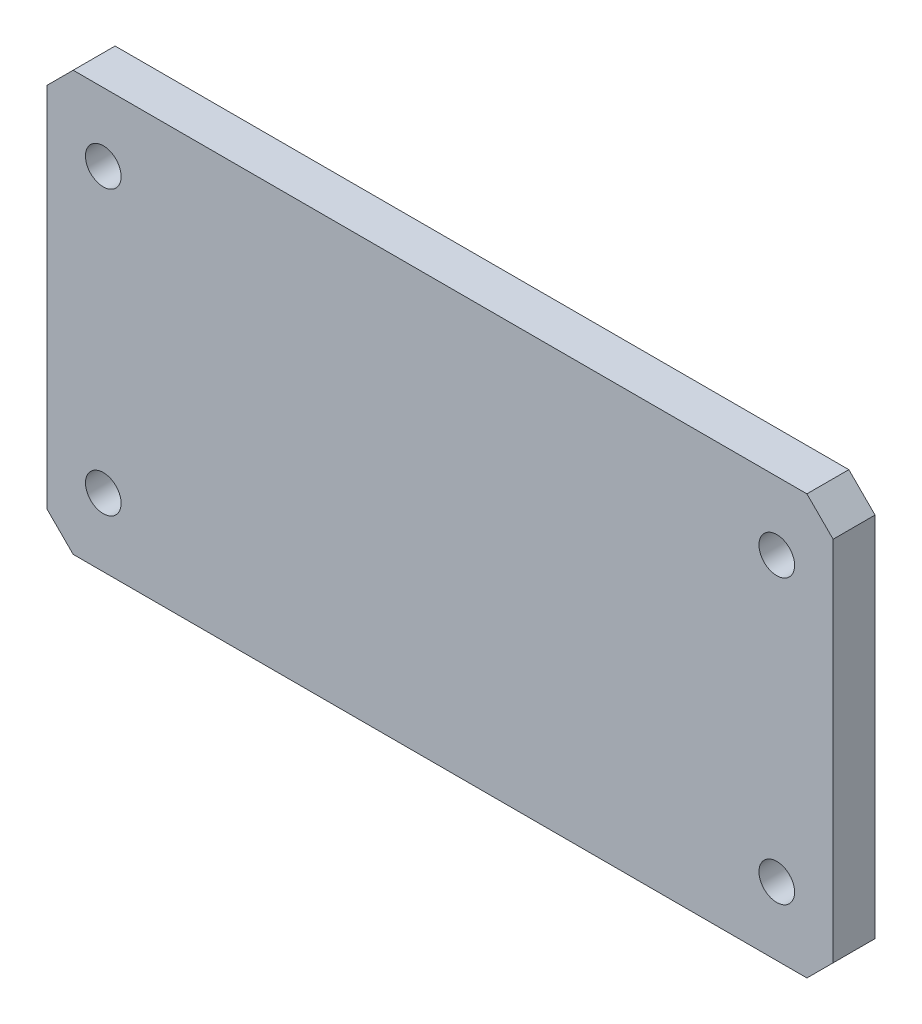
ISO-10303-21;
HEADER;
FILE_DESCRIPTION(('STEP AP214'),'2;1');
FILE_NAME('part.step','',(''),(''),'','','');
FILE_SCHEMA(('AUTOMOTIVE_DESIGN { 1 0 10303 214 1 1 1 1 }'));
ENDSEC;
DATA;
#1=APPLICATION_CONTEXT('core data for automotive mechanical design processes');
#2=APPLICATION_PROTOCOL_DEFINITION('international standard','automotive_design',2000,#1);
#3=PRODUCT_CONTEXT('',#1,'mechanical');
#4=PRODUCT('Part','Part','',(#3));
#5=PRODUCT_RELATED_PRODUCT_CATEGORY('part','',(#4));
#6=PRODUCT_DEFINITION_FORMATION('','',#4);
#7=PRODUCT_DEFINITION_CONTEXT('part definition',#1,'design');
#8=PRODUCT_DEFINITION('design','',#6,#7);
#9=PRODUCT_DEFINITION_SHAPE('','',#8);
#10=(LENGTH_UNIT() NAMED_UNIT(*) SI_UNIT(.MILLI.,.METRE.));
#11=(NAMED_UNIT(*) PLANE_ANGLE_UNIT() SI_UNIT($,.RADIAN.));
#12=(NAMED_UNIT(*) SI_UNIT($,.STERADIAN.) SOLID_ANGLE_UNIT());
#13=UNCERTAINTY_MEASURE_WITH_UNIT(LENGTH_MEASURE(1.E-05),#10,'distance_accuracy_value','');
#14=(GEOMETRIC_REPRESENTATION_CONTEXT(3) GLOBAL_UNCERTAINTY_ASSIGNED_CONTEXT((#13)) GLOBAL_UNIT_ASSIGNED_CONTEXT((#10,
#11,#12)) REPRESENTATION_CONTEXT('',''));
#15=CARTESIAN_POINT('',(0.,0.,0.));
#16=DIRECTION('',(0.,0.,1.));
#17=DIRECTION('',(1.,0.,0.));
#18=AXIS2_PLACEMENT_3D('',#15,#16,#17);
#19=CARTESIAN_POINT('',(75.,-40.,8.));
#20=DIRECTION('',(-1.,0.,0.));
#21=DIRECTION('',(0.,0.,1.));
#22=AXIS2_PLACEMENT_3D('',#19,#20,#21);
#23=PLANE('',#22);
#24=DIRECTION('',(0.,1.,0.));
#25=VECTOR('',#24,1.);
#26=CARTESIAN_POINT('',(75.,-40.,8.));
#27=LINE('',#26,#25);
#28=CARTESIAN_POINT('',(75.,-35.,8.));
#29=VERTEX_POINT('',#28);
#30=CARTESIAN_POINT('',(75.,35.,8.));
#31=VERTEX_POINT('',#30);
#32=EDGE_CURVE('E107',#29,#31,#27,.T.);
#33=ORIENTED_EDGE('',*,*,#32,.F.);
#34=DIRECTION('',(0.,0.,-1.));
#35=VECTOR('',#34,1.);
#36=CARTESIAN_POINT('',(75.,-35.,8.));
#37=LINE('',#36,#35);
#38=CARTESIAN_POINT('',(75.,-35.,0.));
#39=VERTEX_POINT('',#38);
#40=EDGE_CURVE('E133',#29,#39,#37,.T.);
#41=ORIENTED_EDGE('',*,*,#40,.T.);
#42=DIRECTION('',(0.,1.,0.));
#43=VECTOR('',#42,1.);
#44=CARTESIAN_POINT('',(75.,-40.,0.));
#45=LINE('',#44,#43);
#46=CARTESIAN_POINT('',(75.,35.,0.));
#47=VERTEX_POINT('',#46);
#48=EDGE_CURVE('E141',#39,#47,#45,.T.);
#49=ORIENTED_EDGE('',*,*,#48,.T.);
#50=DIRECTION('',(0.,0.,1.));
#51=VECTOR('',#50,1.);
#52=CARTESIAN_POINT('',(75.,35.,8.));
#53=LINE('',#52,#51);
#54=EDGE_CURVE('E131',#47,#31,#53,.T.);
#55=ORIENTED_EDGE('',*,*,#54,.T.);
#56=EDGE_LOOP('',(#33,#41,#49,#55));
#57=FACE_BOUND('',#56,.T.);
#58=ADVANCED_FACE('F16',(#57),#23,.F.);
#59=CARTESIAN_POINT('',(-75.,40.,8.));
#60=DIRECTION('',(0.,-1.,0.));
#61=DIRECTION('',(0.,0.,-1.));
#62=AXIS2_PLACEMENT_3D('',#59,#60,#61);
#63=PLANE('',#62);
#64=DIRECTION('',(-1.,0.,0.));
#65=VECTOR('',#64,1.);
#66=CARTESIAN_POINT('',(-75.,40.,0.));
#67=LINE('',#66,#65);
#68=CARTESIAN_POINT('',(70.,40.,0.));
#69=VERTEX_POINT('',#68);
#70=CARTESIAN_POINT('',(-70.,40.,0.));
#71=VERTEX_POINT('',#70);
#72=EDGE_CURVE('E112',#69,#71,#67,.T.);
#73=ORIENTED_EDGE('',*,*,#72,.T.);
#74=DIRECTION('',(0.,0.,1.));
#75=VECTOR('',#74,1.);
#76=CARTESIAN_POINT('',(-70.,40.,8.));
#77=LINE('',#76,#75);
#78=CARTESIAN_POINT('',(-70.,40.,8.));
#79=VERTEX_POINT('',#78);
#80=EDGE_CURVE('E11',#71,#79,#77,.T.);
#81=ORIENTED_EDGE('',*,*,#80,.T.);
#82=DIRECTION('',(-1.,0.,0.));
#83=VECTOR('',#82,1.);
#84=CARTESIAN_POINT('',(-75.,40.,8.));
#85=LINE('',#84,#83);
#86=CARTESIAN_POINT('',(70.,40.,8.));
#87=VERTEX_POINT('',#86);
#88=EDGE_CURVE('E110',#87,#79,#85,.T.);
#89=ORIENTED_EDGE('',*,*,#88,.F.);
#90=DIRECTION('',(0.,0.,-1.));
#91=VECTOR('',#90,1.);
#92=CARTESIAN_POINT('',(70.,40.,8.));
#93=LINE('',#92,#91);
#94=EDGE_CURVE('E24',#87,#69,#93,.T.);
#95=ORIENTED_EDGE('',*,*,#94,.T.);
#96=EDGE_LOOP('',(#73,#81,#89,#95));
#97=FACE_BOUND('',#96,.T.);
#98=ADVANCED_FACE('F138',(#97),#63,.F.);
#99=CARTESIAN_POINT('',(-75.,-40.,8.));
#100=DIRECTION('',(1.,0.,0.));
#101=DIRECTION('',(0.,0.,-1.));
#102=AXIS2_PLACEMENT_3D('',#99,#100,#101);
#103=PLANE('',#102);
#104=DIRECTION('',(0.,-1.,0.));
#105=VECTOR('',#104,1.);
#106=CARTESIAN_POINT('',(-75.,-40.,0.));
#107=LINE('',#106,#105);
#108=CARTESIAN_POINT('',(-75.,35.,0.));
#109=VERTEX_POINT('',#108);
#110=CARTESIAN_POINT('',(-75.,-35.,0.));
#111=VERTEX_POINT('',#110);
#112=EDGE_CURVE('E108',#109,#111,#107,.T.);
#113=ORIENTED_EDGE('',*,*,#112,.T.);
#114=DIRECTION('',(0.,0.,1.));
#115=VECTOR('',#114,1.);
#116=CARTESIAN_POINT('',(-75.,-35.,8.));
#117=LINE('',#116,#115);
#118=CARTESIAN_POINT('',(-75.,-35.,8.));
#119=VERTEX_POINT('',#118);
#120=EDGE_CURVE('E86',#111,#119,#117,.T.);
#121=ORIENTED_EDGE('',*,*,#120,.T.);
#122=DIRECTION('',(0.,-1.,0.));
#123=VECTOR('',#122,1.);
#124=CARTESIAN_POINT('',(-75.,-40.,8.));
#125=LINE('',#124,#123);
#126=CARTESIAN_POINT('',(-75.,35.,8.));
#127=VERTEX_POINT('',#126);
#128=EDGE_CURVE('E146',#127,#119,#125,.T.);
#129=ORIENTED_EDGE('',*,*,#128,.F.);
#130=DIRECTION('',(0.,0.,-1.));
#131=VECTOR('',#130,1.);
#132=CARTESIAN_POINT('',(-75.,35.,8.));
#133=LINE('',#132,#131);
#134=EDGE_CURVE('E91',#127,#109,#133,.T.);
#135=ORIENTED_EDGE('',*,*,#134,.T.);
#136=EDGE_LOOP('',(#113,#121,#129,#135));
#137=FACE_BOUND('',#136,.T.);
#138=ADVANCED_FACE('F208',(#137),#103,.F.);
#139=CARTESIAN_POINT('',(-75.,-40.,8.));
#140=DIRECTION('',(0.,1.,0.));
#141=DIRECTION('',(0.,0.,1.));
#142=AXIS2_PLACEMENT_3D('',#139,#140,#141);
#143=PLANE('',#142);
#144=DIRECTION('',(1.,0.,0.));
#145=VECTOR('',#144,1.);
#146=CARTESIAN_POINT('',(-75.,-40.,8.));
#147=LINE('',#146,#145);
#148=CARTESIAN_POINT('',(-70.,-40.,8.));
#149=VERTEX_POINT('',#148);
#150=CARTESIAN_POINT('',(70.,-40.,8.));
#151=VERTEX_POINT('',#150);
#152=EDGE_CURVE('E101',#149,#151,#147,.T.);
#153=ORIENTED_EDGE('',*,*,#152,.F.);
#154=DIRECTION('',(0.,0.,-1.));
#155=VECTOR('',#154,1.);
#156=CARTESIAN_POINT('',(-70.,-40.,8.));
#157=LINE('',#156,#155);
#158=CARTESIAN_POINT('',(-70.,-40.,0.));
#159=VERTEX_POINT('',#158);
#160=EDGE_CURVE('E85',#149,#159,#157,.T.);
#161=ORIENTED_EDGE('',*,*,#160,.T.);
#162=DIRECTION('',(1.,0.,0.));
#163=VECTOR('',#162,1.);
#164=CARTESIAN_POINT('',(-75.,-40.,0.));
#165=LINE('',#164,#163);
#166=CARTESIAN_POINT('',(70.,-40.,0.));
#167=VERTEX_POINT('',#166);
#168=EDGE_CURVE('E98',#159,#167,#165,.T.);
#169=ORIENTED_EDGE('',*,*,#168,.T.);
#170=DIRECTION('',(0.,0.,1.));
#171=VECTOR('',#170,1.);
#172=CARTESIAN_POINT('',(70.,-40.,8.));
#173=LINE('',#172,#171);
#174=EDGE_CURVE('E103',#167,#151,#173,.T.);
#175=ORIENTED_EDGE('',*,*,#174,.T.);
#176=EDGE_LOOP('',(#153,#161,#169,#175));
#177=FACE_BOUND('',#176,.T.);
#178=ADVANCED_FACE('F97',(#177),#143,.F.);
#179=CARTESIAN_POINT('',(0.,0.,8.));
#180=DIRECTION('',(0.,0.,-1.));
#181=DIRECTION('',(-1.,0.,0.));
#182=AXIS2_PLACEMENT_3D('',#179,#180,#181);
#183=PLANE('',#182);
#184=CARTESIAN_POINT('',(64.2499999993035,27.,8.));
#185=DIRECTION('',(0.,0.,-1.));
#186=DIRECTION('',(-1.,0.,0.));
#187=AXIS2_PLACEMENT_3D('',#184,#185,#186);
#188=CIRCLE('',#187,3.4);
#189=CARTESIAN_POINT('',(60.8499999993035,27.,8.));
#190=VERTEX_POINT('',#189);
#191=EDGE_CURVE('E167',#190,#190,#188,.T.);
#192=ORIENTED_EDGE('',*,*,#191,.T.);
#193=EDGE_LOOP('',(#192));
#194=FACE_BOUND('',#193,.T.);
#195=CARTESIAN_POINT('',(-64.2499999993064,27.,8.));
#196=DIRECTION('',(0.,0.,-1.));
#197=DIRECTION('',(-1.,0.,0.));
#198=AXIS2_PLACEMENT_3D('',#195,#196,#197);
#199=CIRCLE('',#198,3.4);
#200=CARTESIAN_POINT('',(-67.6499999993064,27.,8.));
#201=VERTEX_POINT('',#200);
#202=EDGE_CURVE('E161',#201,#201,#199,.T.);
#203=ORIENTED_EDGE('',*,*,#202,.T.);
#204=EDGE_LOOP('',(#203));
#205=FACE_BOUND('',#204,.T.);
#206=CARTESIAN_POINT('',(64.2499999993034,-27.,8.));
#207=DIRECTION('',(0.,0.,-1.));
#208=DIRECTION('',(-1.,0.,0.));
#209=AXIS2_PLACEMENT_3D('',#206,#207,#208);
#210=CIRCLE('',#209,3.4);
#211=CARTESIAN_POINT('',(60.8499999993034,-27.,8.));
#212=VERTEX_POINT('',#211);
#213=EDGE_CURVE('E155',#212,#212,#210,.T.);
#214=ORIENTED_EDGE('',*,*,#213,.T.);
#215=EDGE_LOOP('',(#214));
#216=FACE_BOUND('',#215,.T.);
#217=CARTESIAN_POINT('',(-64.2499999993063,-27.,8.));
#218=DIRECTION('',(0.,0.,-1.));
#219=DIRECTION('',(-1.,0.,0.));
#220=AXIS2_PLACEMENT_3D('',#217,#218,#219);
#221=CIRCLE('',#220,3.4);
#222=CARTESIAN_POINT('',(-67.6499999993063,-27.,8.));
#223=VERTEX_POINT('',#222);
#224=EDGE_CURVE('E142',#223,#223,#221,.T.);
#225=ORIENTED_EDGE('',*,*,#224,.T.);
#226=EDGE_LOOP('',(#225));
#227=FACE_BOUND('',#226,.T.);
#228=ORIENTED_EDGE('',*,*,#128,.T.);
#229=DIRECTION('',(-0.707106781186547,0.707106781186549,0.));
#230=VECTOR('',#229,1.);
#231=CARTESIAN_POINT('',(-70.,-40.,8.));
#232=LINE('',#231,#230);
#233=EDGE_CURVE('E129',#119,#149,#232,.F.);
#234=ORIENTED_EDGE('',*,*,#233,.T.);
#235=ORIENTED_EDGE('',*,*,#152,.T.);
#236=DIRECTION('',(-0.707106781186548,-0.707106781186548,0.));
#237=VECTOR('',#236,1.);
#238=CARTESIAN_POINT('',(75.,-35.,8.));
#239=LINE('',#238,#237);
#240=EDGE_CURVE('E127',#151,#29,#239,.F.);
#241=ORIENTED_EDGE('',*,*,#240,.T.);
#242=ORIENTED_EDGE('',*,*,#32,.T.);
#243=DIRECTION('',(0.707106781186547,-0.707106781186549,0.));
#244=VECTOR('',#243,1.);
#245=CARTESIAN_POINT('',(70.,40.,8.));
#246=LINE('',#245,#244);
#247=EDGE_CURVE('E36',#31,#87,#246,.F.);
#248=ORIENTED_EDGE('',*,*,#247,.T.);
#249=ORIENTED_EDGE('',*,*,#88,.T.);
#250=DIRECTION('',(0.707106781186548,0.707106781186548,0.));
#251=VECTOR('',#250,1.);
#252=CARTESIAN_POINT('',(-75.,35.,8.));
#253=LINE('',#252,#251);
#254=EDGE_CURVE('E125',#79,#127,#253,.F.);
#255=ORIENTED_EDGE('',*,*,#254,.T.);
#256=EDGE_LOOP('',(#228,#234,#235,#241,#242,#248,#249,#255));
#257=FACE_BOUND('',#256,.T.);
#258=ADVANCED_FACE('F179',(#194,#205,#216,#227,#257),#183,.F.);
#259=CARTESIAN_POINT('',(0.,0.,0.));
#260=DIRECTION('',(0.,0.,-1.));
#261=DIRECTION('',(-1.,0.,0.));
#262=AXIS2_PLACEMENT_3D('',#259,#260,#261);
#263=PLANE('',#262);
#264=CARTESIAN_POINT('',(64.2499999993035,27.,0.));
#265=DIRECTION('',(0.,0.,-1.));
#266=DIRECTION('',(-1.,0.,0.));
#267=AXIS2_PLACEMENT_3D('',#264,#265,#266);
#268=CIRCLE('',#267,3.4);
#269=CARTESIAN_POINT('',(60.8499999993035,27.,0.));
#270=VERTEX_POINT('',#269);
#271=EDGE_CURVE('E170',#270,#270,#268,.T.);
#272=ORIENTED_EDGE('',*,*,#271,.F.);
#273=EDGE_LOOP('',(#272));
#274=FACE_BOUND('',#273,.T.);
#275=CARTESIAN_POINT('',(-64.2499999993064,27.,0.));
#276=DIRECTION('',(0.,0.,-1.));
#277=DIRECTION('',(-1.,0.,0.));
#278=AXIS2_PLACEMENT_3D('',#275,#276,#277);
#279=CIRCLE('',#278,3.4);
#280=CARTESIAN_POINT('',(-67.6499999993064,27.,0.));
#281=VERTEX_POINT('',#280);
#282=EDGE_CURVE('E164',#281,#281,#279,.T.);
#283=ORIENTED_EDGE('',*,*,#282,.F.);
#284=EDGE_LOOP('',(#283));
#285=FACE_BOUND('',#284,.T.);
#286=CARTESIAN_POINT('',(64.2499999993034,-27.,0.));
#287=DIRECTION('',(0.,0.,-1.));
#288=DIRECTION('',(-1.,0.,0.));
#289=AXIS2_PLACEMENT_3D('',#286,#287,#288);
#290=CIRCLE('',#289,3.4);
#291=CARTESIAN_POINT('',(60.8499999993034,-27.,0.));
#292=VERTEX_POINT('',#291);
#293=EDGE_CURVE('E158',#292,#292,#290,.T.);
#294=ORIENTED_EDGE('',*,*,#293,.F.);
#295=EDGE_LOOP('',(#294));
#296=FACE_BOUND('',#295,.T.);
#297=CARTESIAN_POINT('',(-64.2499999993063,-27.,0.));
#298=DIRECTION('',(0.,0.,-1.));
#299=DIRECTION('',(-1.,0.,0.));
#300=AXIS2_PLACEMENT_3D('',#297,#298,#299);
#301=CIRCLE('',#300,3.4);
#302=CARTESIAN_POINT('',(-67.6499999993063,-27.,0.));
#303=VERTEX_POINT('',#302);
#304=EDGE_CURVE('E152',#303,#303,#301,.T.);
#305=ORIENTED_EDGE('',*,*,#304,.F.);
#306=EDGE_LOOP('',(#305));
#307=FACE_BOUND('',#306,.T.);
#308=ORIENTED_EDGE('',*,*,#168,.F.);
#309=DIRECTION('',(0.707106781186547,-0.707106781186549,0.));
#310=VECTOR('',#309,1.);
#311=CARTESIAN_POINT('',(-55.,-55.,0.));
#312=LINE('',#311,#310);
#313=EDGE_CURVE('E81',#159,#111,#312,.F.);
#314=ORIENTED_EDGE('',*,*,#313,.T.);
#315=ORIENTED_EDGE('',*,*,#112,.F.);
#316=DIRECTION('',(-0.707106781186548,-0.707106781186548,0.));
#317=VECTOR('',#316,1.);
#318=CARTESIAN_POINT('',(-55.,55.,0.));
#319=LINE('',#318,#317);
#320=EDGE_CURVE('E118',#109,#71,#319,.F.);
#321=ORIENTED_EDGE('',*,*,#320,.T.);
#322=ORIENTED_EDGE('',*,*,#72,.F.);
#323=DIRECTION('',(-0.707106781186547,0.707106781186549,0.));
#324=VECTOR('',#323,1.);
#325=CARTESIAN_POINT('',(55.,55.,0.));
#326=LINE('',#325,#324);
#327=EDGE_CURVE('E102',#69,#47,#326,.F.);
#328=ORIENTED_EDGE('',*,*,#327,.T.);
#329=ORIENTED_EDGE('',*,*,#48,.F.);
#330=DIRECTION('',(0.707106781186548,0.707106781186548,0.));
#331=VECTOR('',#330,1.);
#332=CARTESIAN_POINT('',(55.,-55.,0.));
#333=LINE('',#332,#331);
#334=EDGE_CURVE('E92',#39,#167,#333,.F.);
#335=ORIENTED_EDGE('',*,*,#334,.T.);
#336=EDGE_LOOP('',(#308,#314,#315,#321,#322,#328,#329,#335));
#337=FACE_BOUND('',#336,.T.);
#338=ADVANCED_FACE('F105',(#274,#285,#296,#307,#337),#263,.T.);
#339=CARTESIAN_POINT('',(-64.2499999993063,-27.,0.));
#340=DIRECTION('',(0.,0.,-1.));
#341=DIRECTION('',(-1.,0.,0.));
#342=AXIS2_PLACEMENT_3D('',#339,#340,#341);
#343=CYLINDRICAL_SURFACE('',#342,3.4);
#344=ORIENTED_EDGE('',*,*,#224,.F.);
#345=EDGE_LOOP('',(#344));
#346=FACE_BOUND('',#345,.T.);
#347=ORIENTED_EDGE('',*,*,#304,.T.);
#348=EDGE_LOOP('',(#347));
#349=FACE_BOUND('',#348,.T.);
#350=ADVANCED_FACE('F178',(#346,#349),#343,.F.);
#351=CARTESIAN_POINT('',(64.2499999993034,-27.,0.));
#352=DIRECTION('',(0.,0.,-1.));
#353=DIRECTION('',(-1.,0.,0.));
#354=AXIS2_PLACEMENT_3D('',#351,#352,#353);
#355=CYLINDRICAL_SURFACE('',#354,3.4);
#356=ORIENTED_EDGE('',*,*,#213,.F.);
#357=EDGE_LOOP('',(#356));
#358=FACE_BOUND('',#357,.T.);
#359=ORIENTED_EDGE('',*,*,#293,.T.);
#360=EDGE_LOOP('',(#359));
#361=FACE_BOUND('',#360,.T.);
#362=ADVANCED_FACE('F188',(#358,#361),#355,.F.);
#363=CARTESIAN_POINT('',(-64.2499999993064,27.,0.));
#364=DIRECTION('',(0.,0.,-1.));
#365=DIRECTION('',(-1.,0.,0.));
#366=AXIS2_PLACEMENT_3D('',#363,#364,#365);
#367=CYLINDRICAL_SURFACE('',#366,3.4);
#368=ORIENTED_EDGE('',*,*,#202,.F.);
#369=EDGE_LOOP('',(#368));
#370=FACE_BOUND('',#369,.T.);
#371=ORIENTED_EDGE('',*,*,#282,.T.);
#372=EDGE_LOOP('',(#371));
#373=FACE_BOUND('',#372,.T.);
#374=ADVANCED_FACE('F196',(#370,#373),#367,.F.);
#375=CARTESIAN_POINT('',(64.2499999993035,27.,0.));
#376=DIRECTION('',(0.,0.,-1.));
#377=DIRECTION('',(-1.,0.,0.));
#378=AXIS2_PLACEMENT_3D('',#375,#376,#377);
#379=CYLINDRICAL_SURFACE('',#378,3.4);
#380=ORIENTED_EDGE('',*,*,#191,.F.);
#381=EDGE_LOOP('',(#380));
#382=FACE_BOUND('',#381,.T.);
#383=ORIENTED_EDGE('',*,*,#271,.T.);
#384=EDGE_LOOP('',(#383));
#385=FACE_BOUND('',#384,.T.);
#386=ADVANCED_FACE('F174',(#382,#385),#379,.F.);
#387=CARTESIAN_POINT('',(-70.,-40.,8.));
#388=DIRECTION('',(0.707106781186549,0.707106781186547,0.));
#389=DIRECTION('',(0.,0.,-1.));
#390=AXIS2_PLACEMENT_3D('',#387,#388,#389);
#391=PLANE('',#390);
#392=ORIENTED_EDGE('',*,*,#233,.F.);
#393=ORIENTED_EDGE('',*,*,#120,.F.);
#394=ORIENTED_EDGE('',*,*,#313,.F.);
#395=ORIENTED_EDGE('',*,*,#160,.F.);
#396=EDGE_LOOP('',(#392,#393,#394,#395));
#397=FACE_BOUND('',#396,.T.);
#398=ADVANCED_FACE('F84',(#397),#391,.F.);
#399=CARTESIAN_POINT('',(75.,-35.,8.));
#400=DIRECTION('',(-0.707106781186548,0.707106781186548,0.));
#401=DIRECTION('',(0.,0.,-1.));
#402=AXIS2_PLACEMENT_3D('',#399,#400,#401);
#403=PLANE('',#402);
#404=ORIENTED_EDGE('',*,*,#240,.F.);
#405=ORIENTED_EDGE('',*,*,#174,.F.);
#406=ORIENTED_EDGE('',*,*,#334,.F.);
#407=ORIENTED_EDGE('',*,*,#40,.F.);
#408=EDGE_LOOP('',(#404,#405,#406,#407));
#409=FACE_BOUND('',#408,.T.);
#410=ADVANCED_FACE('F215',(#409),#403,.F.);
#411=CARTESIAN_POINT('',(-75.,35.,8.));
#412=DIRECTION('',(0.707106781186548,-0.707106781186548,0.));
#413=DIRECTION('',(0.,0.,-1.));
#414=AXIS2_PLACEMENT_3D('',#411,#412,#413);
#415=PLANE('',#414);
#416=ORIENTED_EDGE('',*,*,#254,.F.);
#417=ORIENTED_EDGE('',*,*,#80,.F.);
#418=ORIENTED_EDGE('',*,*,#320,.F.);
#419=ORIENTED_EDGE('',*,*,#134,.F.);
#420=EDGE_LOOP('',(#416,#417,#418,#419));
#421=FACE_BOUND('',#420,.T.);
#422=ADVANCED_FACE('F217',(#421),#415,.F.);
#423=CARTESIAN_POINT('',(70.,40.,8.));
#424=DIRECTION('',(-0.707106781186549,-0.707106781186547,0.));
#425=DIRECTION('',(0.,0.,-1.));
#426=AXIS2_PLACEMENT_3D('',#423,#424,#425);
#427=PLANE('',#426);
#428=ORIENTED_EDGE('',*,*,#247,.F.);
#429=ORIENTED_EDGE('',*,*,#54,.F.);
#430=ORIENTED_EDGE('',*,*,#327,.F.);
#431=ORIENTED_EDGE('',*,*,#94,.F.);
#432=EDGE_LOOP('',(#428,#429,#430,#431));
#433=FACE_BOUND('',#432,.T.);
#434=ADVANCED_FACE('F18',(#433),#427,.F.);
#435=CLOSED_SHELL('',(#58,#98,#138,#178,#258,#338,#350,#362,#374,#386,#398,#410,#422,#434));
#436=MANIFOLD_SOLID_BREP('B1',#435);
#437=ADVANCED_BREP_SHAPE_REPRESENTATION('',(#18,#436),#14);
#438=SHAPE_DEFINITION_REPRESENTATION(#9,#437);
ENDSEC;
END-ISO-10303-21;
